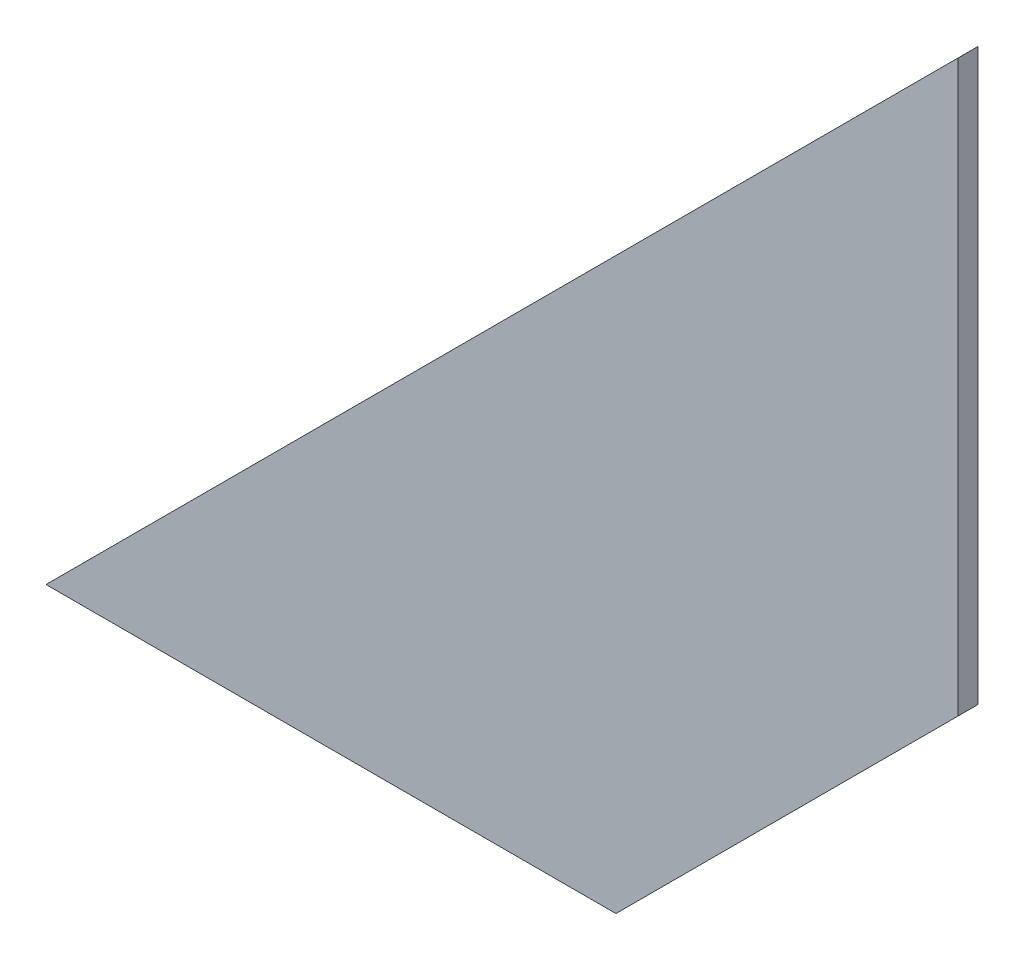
ISO-10303-21;
HEADER;
FILE_DESCRIPTION(('STEP AP214'),'2;1');
FILE_NAME('part.step','',(''),(''),'','','');
FILE_SCHEMA(('AUTOMOTIVE_DESIGN { 1 0 10303 214 1 1 1 1 }'));
ENDSEC;
DATA;
#1=APPLICATION_CONTEXT('core data for automotive mechanical design processes');
#2=APPLICATION_PROTOCOL_DEFINITION('international standard','automotive_design',2000,#1);
#3=PRODUCT_CONTEXT('',#1,'mechanical');
#4=PRODUCT('Part','Part','',(#3));
#5=PRODUCT_RELATED_PRODUCT_CATEGORY('part','',(#4));
#6=PRODUCT_DEFINITION_FORMATION('','',#4);
#7=PRODUCT_DEFINITION_CONTEXT('part definition',#1,'design');
#8=PRODUCT_DEFINITION('design','',#6,#7);
#9=PRODUCT_DEFINITION_SHAPE('','',#8);
#10=(LENGTH_UNIT() NAMED_UNIT(*) SI_UNIT(.MILLI.,.METRE.));
#11=(NAMED_UNIT(*) PLANE_ANGLE_UNIT() SI_UNIT($,.RADIAN.));
#12=(NAMED_UNIT(*) SI_UNIT($,.STERADIAN.) SOLID_ANGLE_UNIT());
#13=UNCERTAINTY_MEASURE_WITH_UNIT(LENGTH_MEASURE(1.E-05),#10,'distance_accuracy_value','');
#14=(GEOMETRIC_REPRESENTATION_CONTEXT(3) GLOBAL_UNCERTAINTY_ASSIGNED_CONTEXT((#13)) GLOBAL_UNIT_ASSIGNED_CONTEXT((#10,
#11,#12)) REPRESENTATION_CONTEXT('',''));
#15=CARTESIAN_POINT('',(0.,0.,0.));
#16=DIRECTION('',(0.,0.,1.));
#17=DIRECTION('',(1.,0.,0.));
#18=AXIS2_PLACEMENT_3D('',#15,#16,#17);
#19=CARTESIAN_POINT('',(452.54833995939,452.54833995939,10.));
#20=DIRECTION('',(0.707106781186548,-0.707106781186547,0.));
#21=DIRECTION('',(0.707106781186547,0.707106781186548,0.));
#22=AXIS2_PLACEMENT_3D('',#19,#20,#21);
#23=PLANE('',#22);
#24=DIRECTION('',(-0.707106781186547,-0.707106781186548,0.));
#25=VECTOR('',#24,1.);
#26=CARTESIAN_POINT('',(452.54833995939,452.54833995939,0.));
#27=LINE('',#26,#25);
#28=CARTESIAN_POINT('',(452.54833995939,452.54833995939,0.));
#29=VERTEX_POINT('',#28);
#30=CARTESIAN_POINT('',(0.,0.,0.));
#31=VERTEX_POINT('',#30);
#32=EDGE_CURVE('E96',#29,#31,#27,.T.);
#33=ORIENTED_EDGE('',*,*,#32,.T.);
#34=DIRECTION('',(0.,0.,-1.));
#35=VECTOR('',#34,1.);
#36=CARTESIAN_POINT('',(0.,0.,10.));
#37=LINE('',#36,#35);
#38=CARTESIAN_POINT('',(0.,0.,10.));
#39=VERTEX_POINT('',#38);
#40=EDGE_CURVE('E11',#39,#31,#37,.T.);
#41=ORIENTED_EDGE('',*,*,#40,.F.);
#42=DIRECTION('',(-0.707106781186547,-0.707106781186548,0.));
#43=VECTOR('',#42,1.);
#44=CARTESIAN_POINT('',(452.54833995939,452.54833995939,10.));
#45=LINE('',#44,#43);
#46=CARTESIAN_POINT('',(452.54833995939,452.54833995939,10.));
#47=VERTEX_POINT('',#46);
#48=EDGE_CURVE('E84',#47,#39,#45,.T.);
#49=ORIENTED_EDGE('',*,*,#48,.F.);
#50=DIRECTION('',(0.,0.,-1.));
#51=VECTOR('',#50,1.);
#52=CARTESIAN_POINT('',(452.54833995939,452.54833995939,10.));
#53=LINE('',#52,#51);
#54=EDGE_CURVE('E92',#47,#29,#53,.T.);
#55=ORIENTED_EDGE('',*,*,#54,.T.);
#56=EDGE_LOOP('',(#33,#41,#49,#55));
#57=FACE_BOUND('',#56,.T.);
#58=ADVANCED_FACE('F33',(#57),#23,.F.);
#59=CARTESIAN_POINT('',(0.,0.,10.));
#60=DIRECTION('',(0.,1.,0.));
#61=DIRECTION('',(-1.,0.,0.));
#62=AXIS2_PLACEMENT_3D('',#59,#60,#61);
#63=PLANE('',#62);
#64=DIRECTION('',(1.,0.,0.));
#65=VECTOR('',#64,1.);
#66=CARTESIAN_POINT('',(0.,0.,0.));
#67=LINE('',#66,#65);
#68=CARTESIAN_POINT('',(282.842712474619,0.,0.));
#69=VERTEX_POINT('',#68);
#70=EDGE_CURVE('E88',#31,#69,#67,.T.);
#71=ORIENTED_EDGE('',*,*,#70,.T.);
#72=DIRECTION('',(0.,0.,-1.));
#73=VECTOR('',#72,1.);
#74=CARTESIAN_POINT('',(282.842712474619,0.,10.));
#75=LINE('',#74,#73);
#76=CARTESIAN_POINT('',(282.842712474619,0.,10.));
#77=VERTEX_POINT('',#76);
#78=EDGE_CURVE('E41',#77,#69,#75,.T.);
#79=ORIENTED_EDGE('',*,*,#78,.F.);
#80=DIRECTION('',(1.,0.,0.));
#81=VECTOR('',#80,1.);
#82=CARTESIAN_POINT('',(0.,0.,10.));
#83=LINE('',#82,#81);
#84=EDGE_CURVE('E79',#39,#77,#83,.T.);
#85=ORIENTED_EDGE('',*,*,#84,.F.);
#86=ORIENTED_EDGE('',*,*,#40,.T.);
#87=EDGE_LOOP('',(#71,#79,#85,#86));
#88=FACE_BOUND('',#87,.T.);
#89=ADVANCED_FACE('F87',(#88),#63,.F.);
#90=CARTESIAN_POINT('',(282.842712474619,0.,10.));
#91=DIRECTION('',(-0.707106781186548,0.707106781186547,0.));
#92=DIRECTION('',(-0.707106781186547,-0.707106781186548,0.));
#93=AXIS2_PLACEMENT_3D('',#90,#91,#92);
#94=PLANE('',#93);
#95=DIRECTION('',(0.707106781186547,0.707106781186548,0.));
#96=VECTOR('',#95,1.);
#97=CARTESIAN_POINT('',(282.842712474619,0.,0.));
#98=LINE('',#97,#96);
#99=CARTESIAN_POINT('',(452.54833995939,169.705627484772,0.));
#100=VERTEX_POINT('',#99);
#101=EDGE_CURVE('E66',#69,#100,#98,.T.);
#102=ORIENTED_EDGE('',*,*,#101,.T.);
#103=DIRECTION('',(0.,0.,-1.));
#104=VECTOR('',#103,1.);
#105=CARTESIAN_POINT('',(452.54833995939,169.705627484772,10.));
#106=LINE('',#105,#104);
#107=CARTESIAN_POINT('',(452.54833995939,169.705627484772,10.));
#108=VERTEX_POINT('',#107);
#109=EDGE_CURVE('E89',#108,#100,#106,.T.);
#110=ORIENTED_EDGE('',*,*,#109,.F.);
#111=DIRECTION('',(0.707106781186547,0.707106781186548,0.));
#112=VECTOR('',#111,1.);
#113=CARTESIAN_POINT('',(282.842712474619,0.,10.));
#114=LINE('',#113,#112);
#115=EDGE_CURVE('E82',#77,#108,#114,.T.);
#116=ORIENTED_EDGE('',*,*,#115,.F.);
#117=ORIENTED_EDGE('',*,*,#78,.T.);
#118=EDGE_LOOP('',(#102,#110,#116,#117));
#119=FACE_BOUND('',#118,.T.);
#120=ADVANCED_FACE('F90',(#119),#94,.F.);
#121=CARTESIAN_POINT('',(452.54833995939,169.705627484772,10.));
#122=DIRECTION('',(-1.,0.,0.));
#123=DIRECTION('',(0.,0.,1.));
#124=AXIS2_PLACEMENT_3D('',#121,#122,#123);
#125=PLANE('',#124);
#126=DIRECTION('',(0.,1.,0.));
#127=VECTOR('',#126,1.);
#128=CARTESIAN_POINT('',(452.54833995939,169.705627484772,0.));
#129=LINE('',#128,#127);
#130=EDGE_CURVE('E72',#100,#29,#129,.T.);
#131=ORIENTED_EDGE('',*,*,#130,.T.);
#132=ORIENTED_EDGE('',*,*,#54,.F.);
#133=DIRECTION('',(0.,1.,0.));
#134=VECTOR('',#133,1.);
#135=CARTESIAN_POINT('',(452.54833995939,169.705627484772,10.));
#136=LINE('',#135,#134);
#137=EDGE_CURVE('E49',#108,#47,#136,.T.);
#138=ORIENTED_EDGE('',*,*,#137,.F.);
#139=ORIENTED_EDGE('',*,*,#109,.T.);
#140=EDGE_LOOP('',(#131,#132,#138,#139));
#141=FACE_BOUND('',#140,.T.);
#142=ADVANCED_FACE('F103',(#141),#125,.F.);
#143=CARTESIAN_POINT('',(0.,0.,10.));
#144=DIRECTION('',(0.,0.,1.));
#145=DIRECTION('',(1.,0.,0.));
#146=AXIS2_PLACEMENT_3D('',#143,#144,#145);
#147=PLANE('',#146);
#148=ORIENTED_EDGE('',*,*,#48,.T.);
#149=ORIENTED_EDGE('',*,*,#84,.T.);
#150=ORIENTED_EDGE('',*,*,#115,.T.);
#151=ORIENTED_EDGE('',*,*,#137,.T.);
#152=EDGE_LOOP('',(#148,#149,#150,#151));
#153=FACE_BOUND('',#152,.T.);
#154=ADVANCED_FACE('F80',(#153),#147,.T.);
#155=CARTESIAN_POINT('',(0.,0.,0.));
#156=DIRECTION('',(0.,0.,1.));
#157=DIRECTION('',(1.,0.,0.));
#158=AXIS2_PLACEMENT_3D('',#155,#156,#157);
#159=PLANE('',#158);
#160=ORIENTED_EDGE('',*,*,#32,.F.);
#161=ORIENTED_EDGE('',*,*,#130,.F.);
#162=ORIENTED_EDGE('',*,*,#101,.F.);
#163=ORIENTED_EDGE('',*,*,#70,.F.);
#164=EDGE_LOOP('',(#160,#161,#162,#163));
#165=FACE_BOUND('',#164,.T.);
#166=ADVANCED_FACE('F106',(#165),#159,.F.);
#167=CLOSED_SHELL('',(#58,#89,#120,#142,#154,#166));
#168=MANIFOLD_SOLID_BREP('B2',#167);
#169=ADVANCED_BREP_SHAPE_REPRESENTATION('',(#18,#168),#14);
#170=SHAPE_DEFINITION_REPRESENTATION(#9,#169);
ENDSEC;
END-ISO-10303-21;
